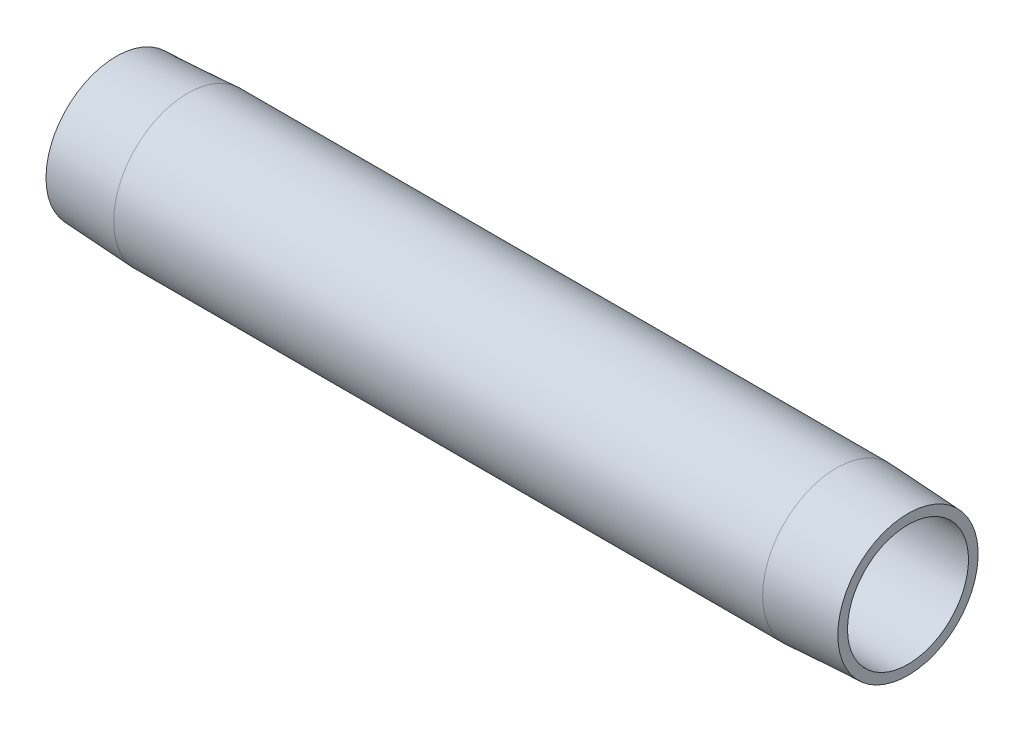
from build123d import *


with BuildPart() as part:
    # Sketch1 → Revolve1 (revolve)
    with BuildSketch(Plane.XY, mode=Mode.PRIVATE) as revolve1_sk:
        Polygon((114.3, 8.73125), (0, 8.73125), (0, 10.127550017), (10.3124, 10.668), (103.9876, 10.668), (114.3, 10.127550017), align=None)
    revolve(revolve1_sk.sketch.rotate(Axis((0, 0, 0), (1, 0, 0)), 90), axis=Axis((0, 0, 0), (1, 0, 0)))


solid = part.part
